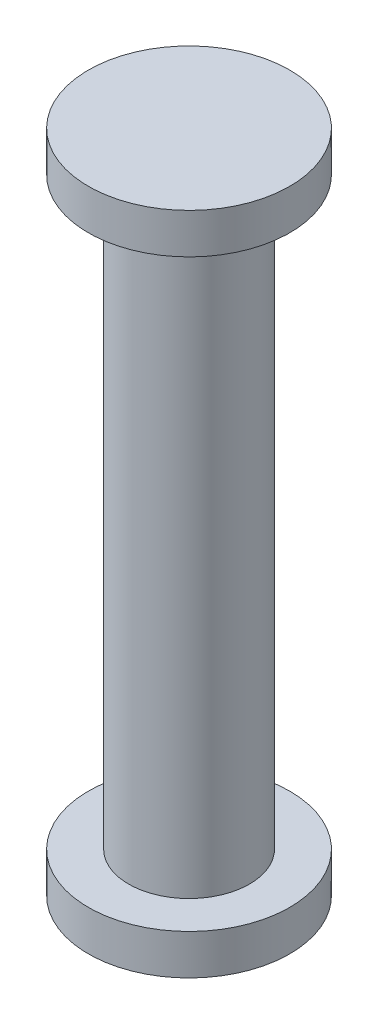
ISO-10303-21;
HEADER;
FILE_DESCRIPTION(('STEP AP214'),'2;1');
FILE_NAME('part.step','',(''),(''),'','','');
FILE_SCHEMA(('AUTOMOTIVE_DESIGN { 1 0 10303 214 1 1 1 1 }'));
ENDSEC;
DATA;
#1=APPLICATION_CONTEXT('core data for automotive mechanical design processes');
#2=APPLICATION_PROTOCOL_DEFINITION('international standard','automotive_design',2000,#1);
#3=PRODUCT_CONTEXT('',#1,'mechanical');
#4=PRODUCT('Part','Part','',(#3));
#5=PRODUCT_RELATED_PRODUCT_CATEGORY('part','',(#4));
#6=PRODUCT_DEFINITION_FORMATION('','',#4);
#7=PRODUCT_DEFINITION_CONTEXT('part definition',#1,'design');
#8=PRODUCT_DEFINITION('design','',#6,#7);
#9=PRODUCT_DEFINITION_SHAPE('','',#8);
#10=(LENGTH_UNIT() NAMED_UNIT(*) SI_UNIT(.MILLI.,.METRE.));
#11=(NAMED_UNIT(*) PLANE_ANGLE_UNIT() SI_UNIT($,.RADIAN.));
#12=(NAMED_UNIT(*) SI_UNIT($,.STERADIAN.) SOLID_ANGLE_UNIT());
#13=UNCERTAINTY_MEASURE_WITH_UNIT(LENGTH_MEASURE(1.E-05),#10,'distance_accuracy_value','');
#14=(GEOMETRIC_REPRESENTATION_CONTEXT(3) GLOBAL_UNCERTAINTY_ASSIGNED_CONTEXT((#13)) GLOBAL_UNIT_ASSIGNED_CONTEXT((#10,
#11,#12)) REPRESENTATION_CONTEXT('',''));
#15=CARTESIAN_POINT('',(0.,0.,0.));
#16=DIRECTION('',(0.,0.,1.));
#17=DIRECTION('',(1.,0.,0.));
#18=AXIS2_PLACEMENT_3D('',#15,#16,#17);
#19=CARTESIAN_POINT('',(-2.5,0.,0.));
#20=DIRECTION('',(0.,1.,0.));
#21=DIRECTION('',(0.,0.,1.));
#22=AXIS2_PLACEMENT_3D('',#19,#20,#21);
#23=PLANE('',#22);
#24=CARTESIAN_POINT('',(0.,0.,0.));
#25=DIRECTION('',(0.,-1.,0.));
#26=DIRECTION('',(0.,0.,-1.));
#27=AXIS2_PLACEMENT_3D('',#24,#25,#26);
#28=CIRCLE('',#27,2.5);
#29=CARTESIAN_POINT('',(0.,0.,-2.5));
#30=VERTEX_POINT('',#29);
#31=EDGE_CURVE('E57',#30,#30,#28,.T.);
#32=ORIENTED_EDGE('',*,*,#31,.T.);
#33=EDGE_LOOP('',(#32));
#34=FACE_BOUND('',#33,.T.);
#35=ADVANCED_FACE('F35',(#34),#23,.F.);
#36=CARTESIAN_POINT('',(0.,16.5,0.));
#37=DIRECTION('',(0.,-1.,0.));
#38=DIRECTION('',(0.,0.,-1.));
#39=AXIS2_PLACEMENT_3D('',#36,#37,#38);
#40=PLANE('',#39);
#41=CARTESIAN_POINT('',(0.,16.5,0.));
#42=DIRECTION('',(0.,-1.,0.));
#43=DIRECTION('',(0.,0.,-1.));
#44=AXIS2_PLACEMENT_3D('',#41,#42,#43);
#45=CIRCLE('',#44,2.5);
#46=CARTESIAN_POINT('',(0.,16.5,-2.5));
#47=VERTEX_POINT('',#46);
#48=EDGE_CURVE('E10',#47,#47,#45,.T.);
#49=ORIENTED_EDGE('',*,*,#48,.F.);
#50=EDGE_LOOP('',(#49));
#51=FACE_BOUND('',#50,.T.);
#52=ADVANCED_FACE('F87',(#51),#40,.F.);
#53=CARTESIAN_POINT('',(0.,0.,0.));
#54=DIRECTION('',(0.,-1.,0.));
#55=DIRECTION('',(0.,0.,-1.));
#56=AXIS2_PLACEMENT_3D('',#53,#54,#55);
#57=CYLINDRICAL_SURFACE('',#56,2.5);
#58=CARTESIAN_POINT('',(0.,15.5,0.));
#59=DIRECTION('',(0.,-1.,0.));
#60=DIRECTION('',(0.,0.,-1.));
#61=AXIS2_PLACEMENT_3D('',#58,#59,#60);
#62=CIRCLE('',#61,2.5);
#63=CARTESIAN_POINT('',(0.,15.5,-2.5));
#64=VERTEX_POINT('',#63);
#65=EDGE_CURVE('E41',#64,#64,#62,.T.);
#66=ORIENTED_EDGE('',*,*,#65,.F.);
#67=EDGE_LOOP('',(#66));
#68=FACE_BOUND('',#67,.T.);
#69=ORIENTED_EDGE('',*,*,#48,.T.);
#70=EDGE_LOOP('',(#69));
#71=FACE_BOUND('',#70,.T.);
#72=ADVANCED_FACE('F82',(#68,#71),#57,.T.);
#73=CARTESIAN_POINT('',(-2.5,15.5,0.));
#74=DIRECTION('',(0.,1.,0.));
#75=DIRECTION('',(0.,0.,1.));
#76=AXIS2_PLACEMENT_3D('',#73,#74,#75);
#77=PLANE('',#76);
#78=CARTESIAN_POINT('',(0.,15.5,0.));
#79=DIRECTION('',(0.,-1.,0.));
#80=DIRECTION('',(0.,0.,-1.));
#81=AXIS2_PLACEMENT_3D('',#78,#79,#80);
#82=CIRCLE('',#81,1.5);
#83=CARTESIAN_POINT('',(0.,15.5,-1.5));
#84=VERTEX_POINT('',#83);
#85=EDGE_CURVE('E45',#84,#84,#82,.T.);
#86=ORIENTED_EDGE('',*,*,#85,.F.);
#87=EDGE_LOOP('',(#86));
#88=FACE_BOUND('',#87,.T.);
#89=ORIENTED_EDGE('',*,*,#65,.T.);
#90=EDGE_LOOP('',(#89));
#91=FACE_BOUND('',#90,.T.);
#92=ADVANCED_FACE('F77',(#88,#91),#77,.F.);
#93=CARTESIAN_POINT('',(0.,0.,0.));
#94=DIRECTION('',(0.,-1.,0.));
#95=DIRECTION('',(0.,0.,-1.));
#96=AXIS2_PLACEMENT_3D('',#93,#94,#95);
#97=CYLINDRICAL_SURFACE('',#96,1.5);
#98=CARTESIAN_POINT('',(0.,1.,0.));
#99=DIRECTION('',(0.,-1.,0.));
#100=DIRECTION('',(0.,0.,-1.));
#101=AXIS2_PLACEMENT_3D('',#98,#99,#100);
#102=CIRCLE('',#101,1.5);
#103=CARTESIAN_POINT('',(0.,1.,-1.5));
#104=VERTEX_POINT('',#103);
#105=EDGE_CURVE('E49',#104,#104,#102,.T.);
#106=ORIENTED_EDGE('',*,*,#105,.F.);
#107=EDGE_LOOP('',(#106));
#108=FACE_BOUND('',#107,.T.);
#109=ORIENTED_EDGE('',*,*,#85,.T.);
#110=EDGE_LOOP('',(#109));
#111=FACE_BOUND('',#110,.T.);
#112=ADVANCED_FACE('F71',(#108,#111),#97,.T.);
#113=CARTESIAN_POINT('',(-1.5,1.,0.));
#114=DIRECTION('',(0.,-1.,0.));
#115=DIRECTION('',(0.,0.,-1.));
#116=AXIS2_PLACEMENT_3D('',#113,#114,#115);
#117=PLANE('',#116);
#118=CARTESIAN_POINT('',(0.,1.,0.));
#119=DIRECTION('',(0.,-1.,0.));
#120=DIRECTION('',(0.,0.,-1.));
#121=AXIS2_PLACEMENT_3D('',#118,#119,#120);
#122=CIRCLE('',#121,2.5);
#123=CARTESIAN_POINT('',(0.,1.,-2.5));
#124=VERTEX_POINT('',#123);
#125=EDGE_CURVE('E54',#124,#124,#122,.T.);
#126=ORIENTED_EDGE('',*,*,#125,.F.);
#127=EDGE_LOOP('',(#126));
#128=FACE_BOUND('',#127,.T.);
#129=ORIENTED_EDGE('',*,*,#105,.T.);
#130=EDGE_LOOP('',(#129));
#131=FACE_BOUND('',#130,.T.);
#132=ADVANCED_FACE('F65',(#128,#131),#117,.F.);
#133=CARTESIAN_POINT('',(0.,0.,0.));
#134=DIRECTION('',(0.,-1.,0.));
#135=DIRECTION('',(0.,0.,-1.));
#136=AXIS2_PLACEMENT_3D('',#133,#134,#135);
#137=CYLINDRICAL_SURFACE('',#136,2.5);
#138=ORIENTED_EDGE('',*,*,#31,.F.);
#139=EDGE_LOOP('',(#138));
#140=FACE_BOUND('',#139,.T.);
#141=ORIENTED_EDGE('',*,*,#125,.T.);
#142=EDGE_LOOP('',(#141));
#143=FACE_BOUND('',#142,.T.);
#144=ADVANCED_FACE('F62',(#140,#143),#137,.T.);
#145=CLOSED_SHELL('',(#35,#52,#72,#92,#112,#132,#144));
#146=MANIFOLD_SOLID_BREP('B2',#145);
#147=ADVANCED_BREP_SHAPE_REPRESENTATION('',(#18,#146),#14);
#148=SHAPE_DEFINITION_REPRESENTATION(#9,#147);
ENDSEC;
END-ISO-10303-21;
